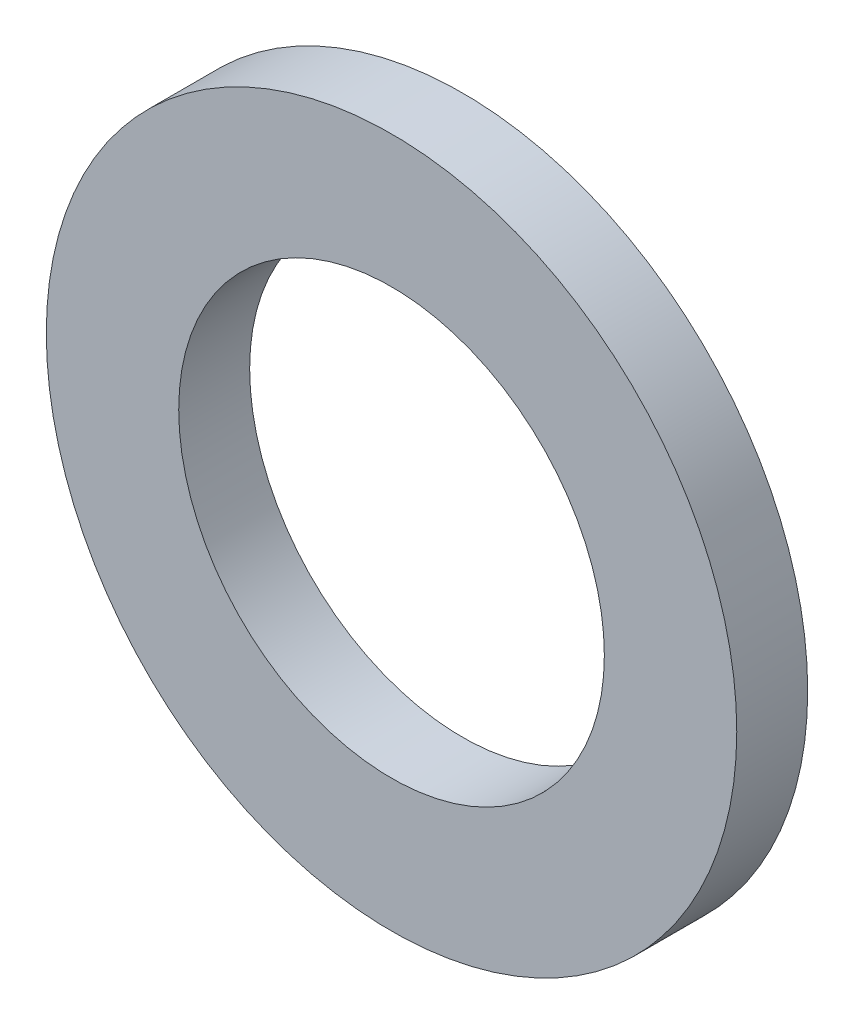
ISO-10303-21;
HEADER;
FILE_DESCRIPTION(('STEP AP214'),'2;1');
FILE_NAME('part.step','',(''),(''),'','','');
FILE_SCHEMA(('AUTOMOTIVE_DESIGN { 1 0 10303 214 1 1 1 1 }'));
ENDSEC;
DATA;
#1=APPLICATION_CONTEXT('core data for automotive mechanical design processes');
#2=APPLICATION_PROTOCOL_DEFINITION('international standard','automotive_design',2000,#1);
#3=PRODUCT_CONTEXT('',#1,'mechanical');
#4=PRODUCT('Part','Part','',(#3));
#5=PRODUCT_RELATED_PRODUCT_CATEGORY('part','',(#4));
#6=PRODUCT_DEFINITION_FORMATION('','',#4);
#7=PRODUCT_DEFINITION_CONTEXT('part definition',#1,'design');
#8=PRODUCT_DEFINITION('design','',#6,#7);
#9=PRODUCT_DEFINITION_SHAPE('','',#8);
#10=(LENGTH_UNIT() NAMED_UNIT(*) SI_UNIT(.MILLI.,.METRE.));
#11=(NAMED_UNIT(*) PLANE_ANGLE_UNIT() SI_UNIT($,.RADIAN.));
#12=(NAMED_UNIT(*) SI_UNIT($,.STERADIAN.) SOLID_ANGLE_UNIT());
#13=UNCERTAINTY_MEASURE_WITH_UNIT(LENGTH_MEASURE(1.E-05),#10,'distance_accuracy_value','');
#14=(GEOMETRIC_REPRESENTATION_CONTEXT(3) GLOBAL_UNCERTAINTY_ASSIGNED_CONTEXT((#13)) GLOBAL_UNIT_ASSIGNED_CONTEXT((#10,
#11,#12)) REPRESENTATION_CONTEXT('',''));
#15=CARTESIAN_POINT('',(0.,0.,0.));
#16=DIRECTION('',(0.,0.,1.));
#17=DIRECTION('',(1.,0.,0.));
#18=AXIS2_PLACEMENT_3D('',#15,#16,#17);
#19=CARTESIAN_POINT('',(0.,0.,10.));
#20=DIRECTION('',(0.,0.,1.));
#21=DIRECTION('',(1.,0.,0.));
#22=AXIS2_PLACEMENT_3D('',#19,#20,#21);
#23=PLANE('',#22);
#24=CARTESIAN_POINT('',(0.,0.,10.));
#25=DIRECTION('',(0.,0.,1.));
#26=DIRECTION('',(1.,0.,0.));
#27=AXIS2_PLACEMENT_3D('',#24,#25,#26);
#28=CIRCLE('',#27,48.6653137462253);
#29=CARTESIAN_POINT('',(48.6653137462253,0.,10.));
#30=VERTEX_POINT('',#29);
#31=EDGE_CURVE('E10',#30,#30,#28,.T.);
#32=ORIENTED_EDGE('',*,*,#31,.T.);
#33=EDGE_LOOP('',(#32));
#34=FACE_BOUND('',#33,.T.);
#35=CARTESIAN_POINT('',(0.,0.,10.));
#36=DIRECTION('',(0.,0.,1.));
#37=DIRECTION('',(1.,0.,0.));
#38=AXIS2_PLACEMENT_3D('',#35,#36,#37);
#39=CIRCLE('',#38,30.);
#40=CARTESIAN_POINT('',(30.,0.,10.));
#41=VERTEX_POINT('',#40);
#42=EDGE_CURVE('E41',#41,#41,#39,.T.);
#43=ORIENTED_EDGE('',*,*,#42,.F.);
#44=EDGE_LOOP('',(#43));
#45=FACE_BOUND('',#44,.T.);
#46=ADVANCED_FACE('F30',(#34,#45),#23,.T.);
#47=CARTESIAN_POINT('',(0.,0.,0.));
#48=DIRECTION('',(0.,0.,1.));
#49=DIRECTION('',(1.,0.,0.));
#50=AXIS2_PLACEMENT_3D('',#47,#48,#49);
#51=PLANE('',#50);
#52=CARTESIAN_POINT('',(0.,0.,0.));
#53=DIRECTION('',(0.,0.,1.));
#54=DIRECTION('',(1.,0.,0.));
#55=AXIS2_PLACEMENT_3D('',#52,#53,#54);
#56=CIRCLE('',#55,48.6653137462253);
#57=CARTESIAN_POINT('',(48.6653137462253,0.,0.));
#58=VERTEX_POINT('',#57);
#59=EDGE_CURVE('E34',#58,#58,#56,.T.);
#60=ORIENTED_EDGE('',*,*,#59,.F.);
#61=EDGE_LOOP('',(#60));
#62=FACE_BOUND('',#61,.T.);
#63=CARTESIAN_POINT('',(0.,0.,0.));
#64=DIRECTION('',(0.,0.,1.));
#65=DIRECTION('',(1.,0.,0.));
#66=AXIS2_PLACEMENT_3D('',#63,#64,#65);
#67=CIRCLE('',#66,30.);
#68=CARTESIAN_POINT('',(30.,0.,0.));
#69=VERTEX_POINT('',#68);
#70=EDGE_CURVE('E43',#69,#69,#67,.T.);
#71=ORIENTED_EDGE('',*,*,#70,.T.);
#72=EDGE_LOOP('',(#71));
#73=FACE_BOUND('',#72,.T.);
#74=ADVANCED_FACE('F53',(#62,#73),#51,.F.);
#75=CARTESIAN_POINT('',(0.,0.,10.));
#76=DIRECTION('',(0.,0.,-1.));
#77=DIRECTION('',(-1.,0.,0.));
#78=AXIS2_PLACEMENT_3D('',#75,#76,#77);
#79=CYLINDRICAL_SURFACE('',#78,48.6653137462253);
#80=ORIENTED_EDGE('',*,*,#31,.F.);
#81=EDGE_LOOP('',(#80));
#82=FACE_BOUND('',#81,.T.);
#83=ORIENTED_EDGE('',*,*,#59,.T.);
#84=EDGE_LOOP('',(#83));
#85=FACE_BOUND('',#84,.T.);
#86=ADVANCED_FACE('F32',(#82,#85),#79,.T.);
#87=CARTESIAN_POINT('',(0.,0.,10.));
#88=DIRECTION('',(0.,0.,-1.));
#89=DIRECTION('',(-1.,0.,0.));
#90=AXIS2_PLACEMENT_3D('',#87,#88,#89);
#91=CYLINDRICAL_SURFACE('',#90,30.);
#92=ORIENTED_EDGE('',*,*,#42,.T.);
#93=EDGE_LOOP('',(#92));
#94=FACE_BOUND('',#93,.T.);
#95=ORIENTED_EDGE('',*,*,#70,.F.);
#96=EDGE_LOOP('',(#95));
#97=FACE_BOUND('',#96,.T.);
#98=ADVANCED_FACE('F49',(#94,#97),#91,.F.);
#99=CLOSED_SHELL('',(#46,#74,#86,#98));
#100=MANIFOLD_SOLID_BREP('B2',#99);
#101=ADVANCED_BREP_SHAPE_REPRESENTATION('',(#18,#100),#14);
#102=SHAPE_DEFINITION_REPRESENTATION(#9,#101);
ENDSEC;
END-ISO-10303-21;
